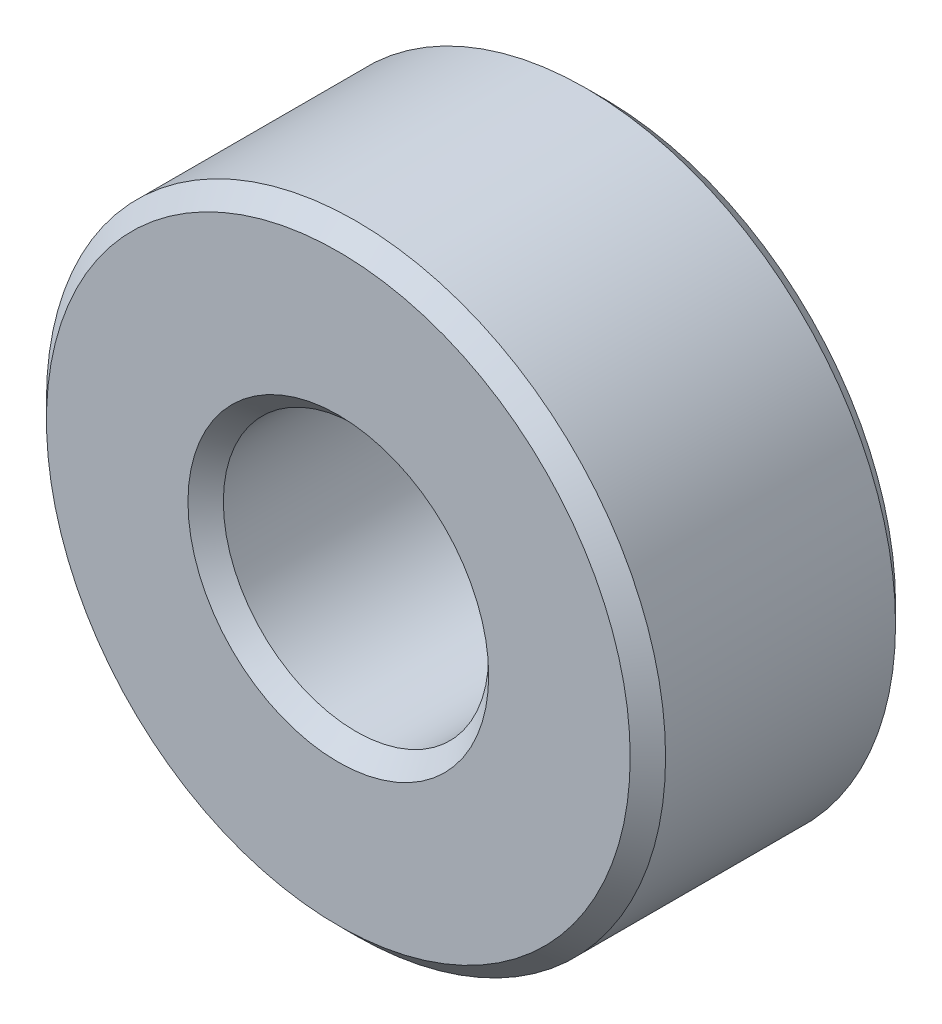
ISO-10303-21;
HEADER;
FILE_DESCRIPTION(('STEP AP214'),'2;1');
FILE_NAME('part.step','',(''),(''),'','','');
FILE_SCHEMA(('AUTOMOTIVE_DESIGN { 1 0 10303 214 1 1 1 1 }'));
ENDSEC;
DATA;
#1=APPLICATION_CONTEXT('core data for automotive mechanical design processes');
#2=APPLICATION_PROTOCOL_DEFINITION('international standard','automotive_design',2000,#1);
#3=PRODUCT_CONTEXT('',#1,'mechanical');
#4=PRODUCT('Part','Part','',(#3));
#5=PRODUCT_RELATED_PRODUCT_CATEGORY('part','',(#4));
#6=PRODUCT_DEFINITION_FORMATION('','',#4);
#7=PRODUCT_DEFINITION_CONTEXT('part definition',#1,'design');
#8=PRODUCT_DEFINITION('design','',#6,#7);
#9=PRODUCT_DEFINITION_SHAPE('','',#8);
#10=(LENGTH_UNIT() NAMED_UNIT(*) SI_UNIT(.MILLI.,.METRE.));
#11=(NAMED_UNIT(*) PLANE_ANGLE_UNIT() SI_UNIT($,.RADIAN.));
#12=(NAMED_UNIT(*) SI_UNIT($,.STERADIAN.) SOLID_ANGLE_UNIT());
#13=UNCERTAINTY_MEASURE_WITH_UNIT(LENGTH_MEASURE(1.E-05),#10,'distance_accuracy_value','');
#14=(GEOMETRIC_REPRESENTATION_CONTEXT(3) GLOBAL_UNCERTAINTY_ASSIGNED_CONTEXT((#13)) GLOBAL_UNIT_ASSIGNED_CONTEXT((#10,
#11,#12)) REPRESENTATION_CONTEXT('',''));
#15=CARTESIAN_POINT('',(0.,0.,0.));
#16=DIRECTION('',(0.,0.,1.));
#17=DIRECTION('',(1.,0.,0.));
#18=AXIS2_PLACEMENT_3D('',#15,#16,#17);
#19=CARTESIAN_POINT('',(0.,0.,1.5));
#20=DIRECTION('',(0.,0.,1.));
#21=DIRECTION('',(1.,0.,0.));
#22=AXIS2_PLACEMENT_3D('',#19,#20,#21);
#23=PLANE('',#22);
#24=CARTESIAN_POINT('',(0.,0.,1.5));
#25=DIRECTION('',(0.,0.,1.));
#26=DIRECTION('',(1.,0.,0.));
#27=AXIS2_PLACEMENT_3D('',#24,#25,#26);
#28=CIRCLE('',#27,1.7);
#29=CARTESIAN_POINT('',(1.7,0.,1.5));
#30=VERTEX_POINT('',#29);
#31=EDGE_CURVE('E10',#30,#30,#28,.F.);
#32=ORIENTED_EDGE('',*,*,#31,.T.);
#33=EDGE_LOOP('',(#32));
#34=FACE_BOUND('',#33,.T.);
#35=CARTESIAN_POINT('',(0.,0.,1.5));
#36=DIRECTION('',(0.,0.,1.));
#37=DIRECTION('',(1.,0.,0.));
#38=AXIS2_PLACEMENT_3D('',#35,#36,#37);
#39=CIRCLE('',#38,3.3);
#40=CARTESIAN_POINT('',(3.3,0.,1.5));
#41=VERTEX_POINT('',#40);
#42=EDGE_CURVE('E36',#41,#41,#39,.T.);
#43=ORIENTED_EDGE('',*,*,#42,.T.);
#44=EDGE_LOOP('',(#43));
#45=FACE_BOUND('',#44,.T.);
#46=ADVANCED_FACE('F29',(#34,#45),#23,.T.);
#47=CARTESIAN_POINT('',(0.,0.,-1.5));
#48=DIRECTION('',(0.,0.,1.));
#49=DIRECTION('',(1.,0.,0.));
#50=AXIS2_PLACEMENT_3D('',#47,#48,#49);
#51=PLANE('',#50);
#52=CARTESIAN_POINT('',(0.,0.,-1.5));
#53=DIRECTION('',(0.,0.,1.));
#54=DIRECTION('',(1.,0.,0.));
#55=AXIS2_PLACEMENT_3D('',#52,#53,#54);
#56=CIRCLE('',#55,1.7);
#57=CARTESIAN_POINT('',(1.7,0.,-1.5));
#58=VERTEX_POINT('',#57);
#59=EDGE_CURVE('E55',#58,#58,#56,.T.);
#60=ORIENTED_EDGE('',*,*,#59,.T.);
#61=EDGE_LOOP('',(#60));
#62=FACE_BOUND('',#61,.T.);
#63=CARTESIAN_POINT('',(0.,0.,-1.5));
#64=DIRECTION('',(0.,0.,1.));
#65=DIRECTION('',(1.,0.,0.));
#66=AXIS2_PLACEMENT_3D('',#63,#64,#65);
#67=CIRCLE('',#66,3.3);
#68=CARTESIAN_POINT('',(3.3,0.,-1.5));
#69=VERTEX_POINT('',#68);
#70=EDGE_CURVE('E58',#69,#69,#67,.F.);
#71=ORIENTED_EDGE('',*,*,#70,.T.);
#72=EDGE_LOOP('',(#71));
#73=FACE_BOUND('',#72,.T.);
#74=ADVANCED_FACE('F62',(#62,#73),#51,.F.);
#75=CARTESIAN_POINT('',(0.,0.,1.5));
#76=DIRECTION('',(0.,0.,-1.));
#77=DIRECTION('',(-1.,0.,0.));
#78=AXIS2_PLACEMENT_3D('',#75,#76,#77);
#79=CYLINDRICAL_SURFACE('',#78,3.5);
#80=CARTESIAN_POINT('',(0.,0.,-1.3));
#81=DIRECTION('',(0.,0.,1.));
#82=DIRECTION('',(1.,0.,0.));
#83=AXIS2_PLACEMENT_3D('',#80,#81,#82);
#84=CIRCLE('',#83,3.5);
#85=CARTESIAN_POINT('',(3.5,0.,-1.3));
#86=VERTEX_POINT('',#85);
#87=EDGE_CURVE('E40',#86,#86,#84,.T.);
#88=ORIENTED_EDGE('',*,*,#87,.T.);
#89=EDGE_LOOP('',(#88));
#90=FACE_BOUND('',#89,.T.);
#91=CARTESIAN_POINT('',(0.,0.,1.3));
#92=DIRECTION('',(0.,0.,1.));
#93=DIRECTION('',(1.,0.,0.));
#94=AXIS2_PLACEMENT_3D('',#91,#92,#93);
#95=CIRCLE('',#94,3.5);
#96=CARTESIAN_POINT('',(3.5,0.,1.3));
#97=VERTEX_POINT('',#96);
#98=EDGE_CURVE('E44',#97,#97,#95,.F.);
#99=ORIENTED_EDGE('',*,*,#98,.T.);
#100=EDGE_LOOP('',(#99));
#101=FACE_BOUND('',#100,.T.);
#102=ADVANCED_FACE('F31',(#90,#101),#79,.T.);
#103=CARTESIAN_POINT('',(0.,0.,1.5));
#104=DIRECTION('',(0.,0.,-1.));
#105=DIRECTION('',(-1.,0.,0.));
#106=AXIS2_PLACEMENT_3D('',#103,#104,#105);
#107=CYLINDRICAL_SURFACE('',#106,1.5);
#108=CARTESIAN_POINT('',(0.,0.,-1.3));
#109=DIRECTION('',(0.,0.,1.));
#110=DIRECTION('',(1.,0.,0.));
#111=AXIS2_PLACEMENT_3D('',#108,#109,#110);
#112=CIRCLE('',#111,1.5);
#113=CARTESIAN_POINT('',(1.5,0.,-1.3));
#114=VERTEX_POINT('',#113);
#115=EDGE_CURVE('E49',#114,#114,#112,.F.);
#116=ORIENTED_EDGE('',*,*,#115,.T.);
#117=EDGE_LOOP('',(#116));
#118=FACE_BOUND('',#117,.T.);
#119=CARTESIAN_POINT('',(0.,0.,1.3));
#120=DIRECTION('',(0.,0.,1.));
#121=DIRECTION('',(1.,0.,0.));
#122=AXIS2_PLACEMENT_3D('',#119,#120,#121);
#123=CIRCLE('',#122,1.5);
#124=CARTESIAN_POINT('',(1.5,0.,1.3));
#125=VERTEX_POINT('',#124);
#126=EDGE_CURVE('E52',#125,#125,#123,.T.);
#127=ORIENTED_EDGE('',*,*,#126,.T.);
#128=EDGE_LOOP('',(#127));
#129=FACE_BOUND('',#128,.T.);
#130=ADVANCED_FACE('F74',(#118,#129),#107,.F.);
#131=CARTESIAN_POINT('',(0.,0.,-1.5));
#132=DIRECTION('',(0.,0.,-1.));
#133=DIRECTION('',(-1.,0.,0.));
#134=AXIS2_PLACEMENT_3D('',#131,#132,#133);
#135=CONICAL_SURFACE('',#134,1.7,0.785398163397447);
#136=ORIENTED_EDGE('',*,*,#115,.F.);
#137=EDGE_LOOP('',(#136));
#138=FACE_BOUND('',#137,.T.);
#139=ORIENTED_EDGE('',*,*,#59,.F.);
#140=EDGE_LOOP('',(#139));
#141=FACE_BOUND('',#140,.T.);
#142=ADVANCED_FACE('F68',(#138,#141),#135,.F.);
#143=CARTESIAN_POINT('',(0.,0.,-1.3));
#144=DIRECTION('',(0.,0.,1.));
#145=DIRECTION('',(1.,0.,0.));
#146=AXIS2_PLACEMENT_3D('',#143,#144,#145);
#147=CONICAL_SURFACE('',#146,3.5,0.78539816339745);
#148=ORIENTED_EDGE('',*,*,#70,.F.);
#149=EDGE_LOOP('',(#148));
#150=FACE_BOUND('',#149,.T.);
#151=ORIENTED_EDGE('',*,*,#87,.F.);
#152=EDGE_LOOP('',(#151));
#153=FACE_BOUND('',#152,.T.);
#154=ADVANCED_FACE('F64',(#150,#153),#147,.T.);
#155=CARTESIAN_POINT('',(0.,0.,1.3));
#156=DIRECTION('',(0.,0.,1.));
#157=DIRECTION('',(1.,0.,0.));
#158=AXIS2_PLACEMENT_3D('',#155,#156,#157);
#159=CONICAL_SURFACE('',#158,1.5,0.78539816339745);
#160=ORIENTED_EDGE('',*,*,#31,.F.);
#161=EDGE_LOOP('',(#160));
#162=FACE_BOUND('',#161,.T.);
#163=ORIENTED_EDGE('',*,*,#126,.F.);
#164=EDGE_LOOP('',(#163));
#165=FACE_BOUND('',#164,.T.);
#166=ADVANCED_FACE('F67',(#162,#165),#159,.F.);
#167=CARTESIAN_POINT('',(0.,0.,1.5));
#168=DIRECTION('',(0.,0.,-1.));
#169=DIRECTION('',(-1.,0.,0.));
#170=AXIS2_PLACEMENT_3D('',#167,#168,#169);
#171=CONICAL_SURFACE('',#170,3.3,0.785398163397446);
#172=ORIENTED_EDGE('',*,*,#98,.F.);
#173=EDGE_LOOP('',(#172));
#174=FACE_BOUND('',#173,.T.);
#175=ORIENTED_EDGE('',*,*,#42,.F.);
#176=EDGE_LOOP('',(#175));
#177=FACE_BOUND('',#176,.T.);
#178=ADVANCED_FACE('F77',(#174,#177),#171,.T.);
#179=CLOSED_SHELL('',(#46,#74,#102,#130,#142,#154,#166,#178));
#180=MANIFOLD_SOLID_BREP('B2',#179);
#181=ADVANCED_BREP_SHAPE_REPRESENTATION('',(#18,#180),#14);
#182=SHAPE_DEFINITION_REPRESENTATION(#9,#181);
ENDSEC;
END-ISO-10303-21;
